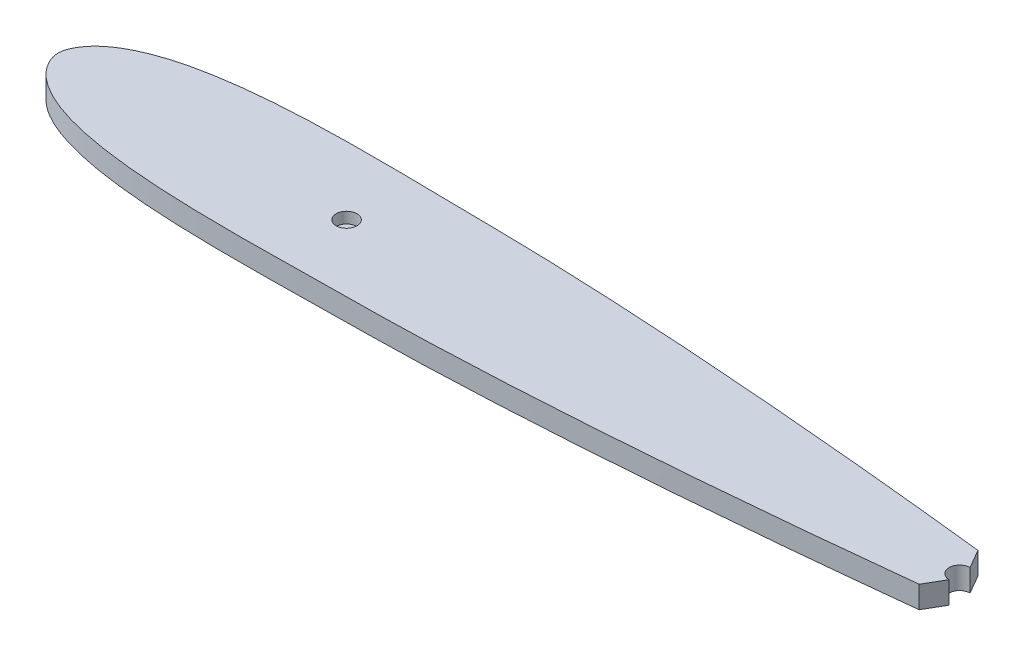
from build123d import *

# Parameters (mm, degrees)
BOSS_EXTRUDE1_DEPTH     = 3.175
SKETCH2_R               = 1.5
CUT_EXTRUDE1_DEPTH      = 3.175
SKETCH3_R               = 1.5
CUT_EXTRUDE2_DEPTH      = 1.5875
SKETCH4_R               = 1.5
CUT_EXTRUDE3_DEPTH      = 1.5875
CUT_EXTRUDE4_DEPTH      = 92.485553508
CUT_EXTRUDE4_DEPTH_BACK = 92.485553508
CUT_EXTRUDE5_DEPTH      = 92.485553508
CUT_EXTRUDE5_DEPTH_BACK = 92.485553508


with BuildPart() as part:
    # Sketch1 → Boss-Extrude1 (new body)
    with BuildSketch(Plane(origin=(0, 0, 0), x_dir=(1, 0, 0), z_dir=(0, 1, 0))):
        with BuildLine():
            Line((71.930329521, -9.051325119), (71.95187572, -9.064686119))
            add(Edge.make_bspline(
                [(71.930329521, -9.051325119), (68.796577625, -8.61956797), (63.000297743, -7.814748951), (54.530823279, -6.734607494), (46.530733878, -5.765346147), (35.867300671, -4.551227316), (25.200379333, -3.439215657), (14.530248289, -2.436250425), (6.530078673, -1.74840973), (-1.469801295, -1.123573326), (-9.523202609, -0.572586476), (-17.57636279, -0.101076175), (-25.630378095, 0.248033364), (-33.630903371, 0.505985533), (-40.24649096, 0.501477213), (-45.525683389, 0.624417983), (-52.13916052, 0.716510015), (-60.146425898, 0.720540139), (-68.152882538, 0.297734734), (-73.218636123, -0.266196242), (-76.692201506, -0.835754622), (-79.361034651, -1.443113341), (-81.488054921, -2.086195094), (-83.09795042, -2.674592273), (-84.71730667, -3.412412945), (-86.36534105, -4.379172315), (-87.732428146, -5.509796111), (-88.936439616, -7.023186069), (-89.822650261, -9.059489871), (-88.936439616, -11.095793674), (-87.732428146, -12.609183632), (-86.36534105, -13.739807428), (-84.71730667, -14.706566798), (-83.09795042, -15.44438747), (-81.488054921, -16.032784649), (-79.361034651, -16.675866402), (-76.692201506, -17.283225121), (-73.218636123, -17.852783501), (-68.152882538, -18.416714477), (-60.146425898, -18.839519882), (-52.13916052, -18.835489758), (-45.525683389, -18.743397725), (-40.24649096, -18.620456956), (-33.630903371, -18.624965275), (-25.630378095, -18.367013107), (-17.57636279, -18.017903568), (-9.523202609, -17.546393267), (-1.469801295, -16.995406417), (6.530078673, -16.370570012), (14.530248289, -15.682729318), (25.200379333, -14.679764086), (35.867300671, -13.567752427), (46.530733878, -12.353633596), (54.530823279, -11.384372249), (63.007489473, -10.303313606), (68.810939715, -9.497417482), (71.95187572, -9.064686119)],
                knots=[-0.004320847, -0.004320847, -0.004320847, -0.004320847, 0.024634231, 0.04924287, 0.07382978, 0.098396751, 0.147478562, 0.171994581, 0.196493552, 0.220976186, 0.245442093, 0.270380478, 0.294812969, 0.319231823, 0.343641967, 0.355360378, 0.36756608, 0.404182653, 0.428636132, 0.440920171, 0.450818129, 0.460843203, 0.465945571, 0.471149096, 0.476522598, 0.482208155, 0.488618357, 0.492567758, 0.5, 0.507432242, 0.511381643, 0.517791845, 0.523477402, 0.528850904, 0.534054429, 0.539156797, 0.549181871, 0.559079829, 0.571363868, 0.595817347, 0.63243392, 0.644639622, 0.656358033, 0.680768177, 0.705187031, 0.729619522, 0.754557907, 0.779023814, 0.803506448, 0.828005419, 0.852521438, 0.901603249, 0.92617022, 0.95075713, 0.975365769, 1.004387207, 1.004387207, 1.004387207, 1.004387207], degree=3))
        make_face()
    extrude(amount=BOSS_EXTRUDE1_DEPTH)

    # Sketch2 → Cut-Extrude1 (cut)
    with BuildSketch(Plane(origin=(0, 3.175, 0), x_dir=(1, 0, 0), z_dir=(0, 1, 0))):
        with Locations(Location((39.930329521, -9.051325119, 0), (0, 0, 270))):
            Circle(SKETCH2_R)
    extrude(amount=-CUT_EXTRUDE1_DEPTH, mode=Mode.SUBTRACT)

    # Sketch3 → Cut-Extrude2 (cut)
    with BuildSketch(Plane(origin=(0, 3.175, 0), x_dir=(1, 0, 0), z_dir=(0, 1, 0))):
        with Locations(Location((-48.04812428, -9.064686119, 0), (0, 0, 270))):
            Circle(SKETCH3_R)
    extrude(amount=-CUT_EXTRUDE2_DEPTH, mode=Mode.SUBTRACT)

    # Sketch4 → Cut-Extrude3 (cut)
    with BuildSketch(Plane.XZ):
        with Locations(Location((-73.269670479, 9.051325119, 0), (0, 0, 270))):
            Circle(SKETCH4_R)
    extrude(amount=-CUT_EXTRUDE3_DEPTH, mode=Mode.SUBTRACT)

    # Sketch5 → Cut-Extrude4 (cut, two sides: drawn at the far end of the back side and taken through both)
    with BuildSketch(Plane(origin=(0, 3.175, 0), x_dir=(1, 0, 0), z_dir=(0, 1, 0)).offset(-CUT_EXTRUDE4_DEPTH_BACK)):
        with BuildLine():
            Line((39.930329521, -5.018688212), (39.930329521, -7.551325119))
            ThreePointArc((39.930329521, -7.551325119), (41.430329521, -9.051325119), (39.930329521, -10.551325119))
            Line((39.930329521, -10.551325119), (39.930329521, -13.100291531))
            add(Edge.make_bspline(
                [(39.930329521, -13.100291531), (42.130061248, -12.854387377), (46.997832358, -12.297041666), (54.530823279, -11.384372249), (63.007489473, -10.303313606), (68.810939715, -9.497417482), (71.95187572, -9.064686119)],
                knots=[0.905909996, 0.905909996, 0.905909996, 0.905909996, 0.92617022, 0.95075713, 0.975365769, 1.004387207, 1.004387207, 1.004387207, 1.004387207], degree=3))
            Line((71.95187572, -9.064686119), (71.930329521, -9.051325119))
            add(Edge.make_bspline(
                [(71.930329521, -9.051325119), (68.796577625, -8.61956797), (63.000297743, -7.814748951), (54.530823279, -6.734607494), (46.997832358, -5.821938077), (42.130061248, -5.264592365), (39.930329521, -5.018688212)],
                knots=[-0.004320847, -0.004320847, -0.004320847, -0.004320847, 0.024634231, 0.04924287, 0.07382978, 0.094090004, 0.094090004, 0.094090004, 0.094090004], degree=3))
        make_face()
    extrude(amount=CUT_EXTRUDE4_DEPTH + CUT_EXTRUDE4_DEPTH_BACK, mode=Mode.SUBTRACT)

    # Sketch6 → Cut-Extrude5 (cut, two sides: drawn at the far end of the back side and taken through both)
    with BuildSketch(Plane(origin=(0, 3.175, 0), x_dir=(1, 0, 0), z_dir=(0, 1, 0)).offset(-CUT_EXTRUDE5_DEPTH_BACK)):
        with BuildLine():
            Line((39.930329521, -7.551325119), (38.367803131, -4.844950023))
            add(Edge.make_bspline(
                [(39.930329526, -5.018629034), (39.409523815, -4.960409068), (38.888681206, -4.902518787), (38.367803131, -4.844950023)],
                knots=[0.094090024, 0.094090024, 0.094090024, 0.094090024, 0.098886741, 0.098886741, 0.098886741, 0.098886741], degree=3))
            Line((39.930329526, -5.018629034), (39.930329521, -7.551325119))
        make_face()
        with BuildLine():
            Line((39.930329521, -10.551325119), (38.357733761, -13.275140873))
            add(Edge.make_bspline(
                [(38.357733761, -13.275140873), (38.881968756, -13.217205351), (39.406167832, -13.158944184), (39.930329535, -13.10034908)],
                knots=[0.901082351, 0.901082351, 0.901082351, 0.901082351, 0.905909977, 0.905909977, 0.905909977, 0.905909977], degree=3))
            Line((39.930329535, -13.10034908), (39.930329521, -10.551325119))
        make_face()
    extrude(amount=CUT_EXTRUDE5_DEPTH + CUT_EXTRUDE5_DEPTH_BACK, mode=Mode.SUBTRACT)


solid = part.part
